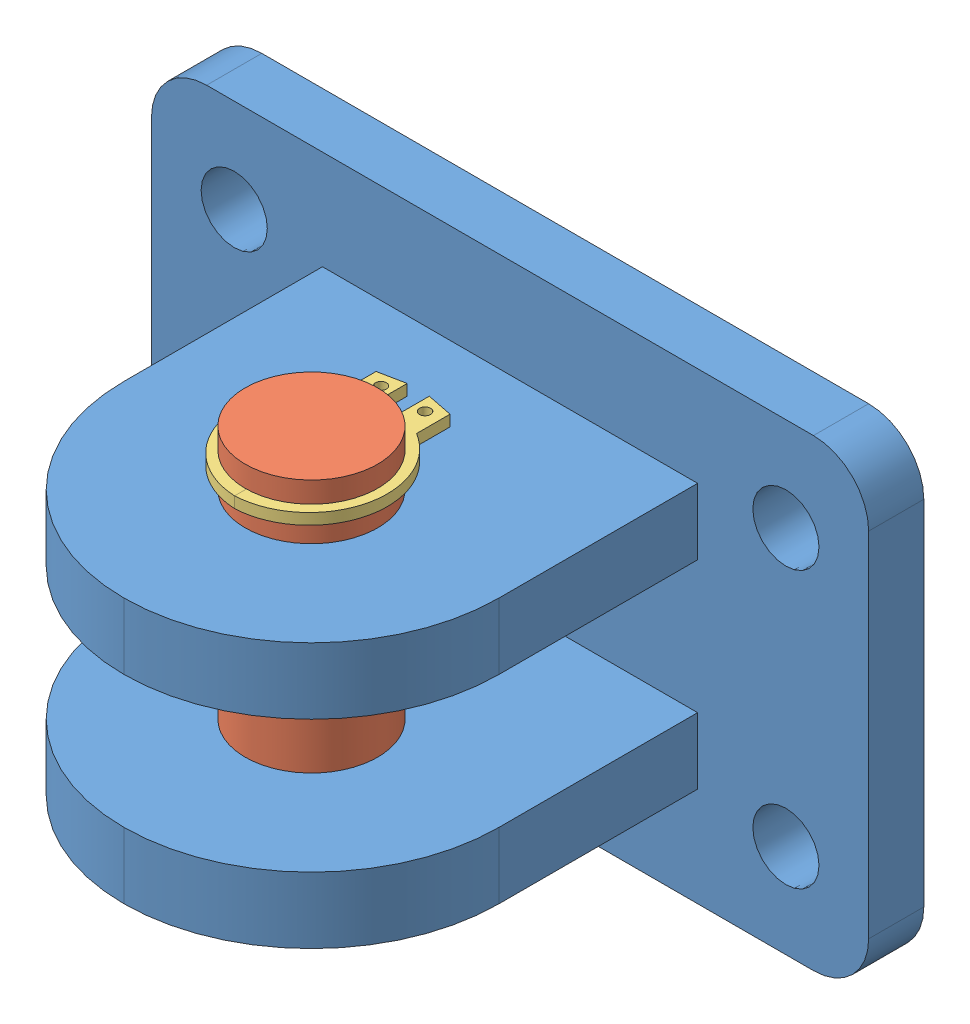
SolidWorks assembly TP_Chape.SLDASM, configuration Défaut (file format 16000). Lengths in mm.
Overall size (65 42 40).
3 component instances, 3 part files, 5 mates.
Components (placement in the parent):
- Chape-1: Chape.SLDPRT [Défaut] at origin size (65 42 40)
- Axe chape-1: Axe chape.SLDPRT [Défaut] at (0 -15 23) x (0 1 0) z (-0.026859 0 0.999639) size (32 15 15)
- Anneau_elastique_pour_arbre_O12-1: Anneau_elastique_pour_arbre_O12.SLDPRT [Défaut] at (0 15 23) x (1 0 0) z (0 -1 0) size (13.53 16.64 1)
Mates (geometry in assembly coordinates):
- Coaxial1: concentric anti-aligned: cylinder of Chape-1 through (0 -21 23) axis (0 1 0) radius 6; cylinder of Axe chape-1 through (0 -15 23) axis (0 -1 0) radius 6
- Coïncidente2: coincident anti-aligned: plane of Chape-1 through (-17 -12 40) normal (0 -1 0); plane of Axe chape-1 through (-7.4973 -12 22.7986) normal (0 1 0)
- Coïncidente3: coincident anti-aligned: plane of Axe chape-1 through (-5.9978 14 22.8388) normal (0 1 0); plane of Anneau_elastique_pour_arbre_O12-1 through (0 14 23) normal (0 -1 0)
- Parallèle1: parallel anti-aligned: plane of Chape-1 through (-17 12 40) normal (-1 0 0); plane of Anneau_elastique_pour_arbre_O12-1 through (3.3518 15 13.791) normal (1 0 0)
- Coaxial2: concentric anti-aligned: cylinder of Axe chape-1 through (0 -15 23) axis (0 -1 0) radius 5.75; cylinder of Anneau_elastique_pour_arbre_O12-1 through (0 14 23) axis (0 1 0) radius 5.75
